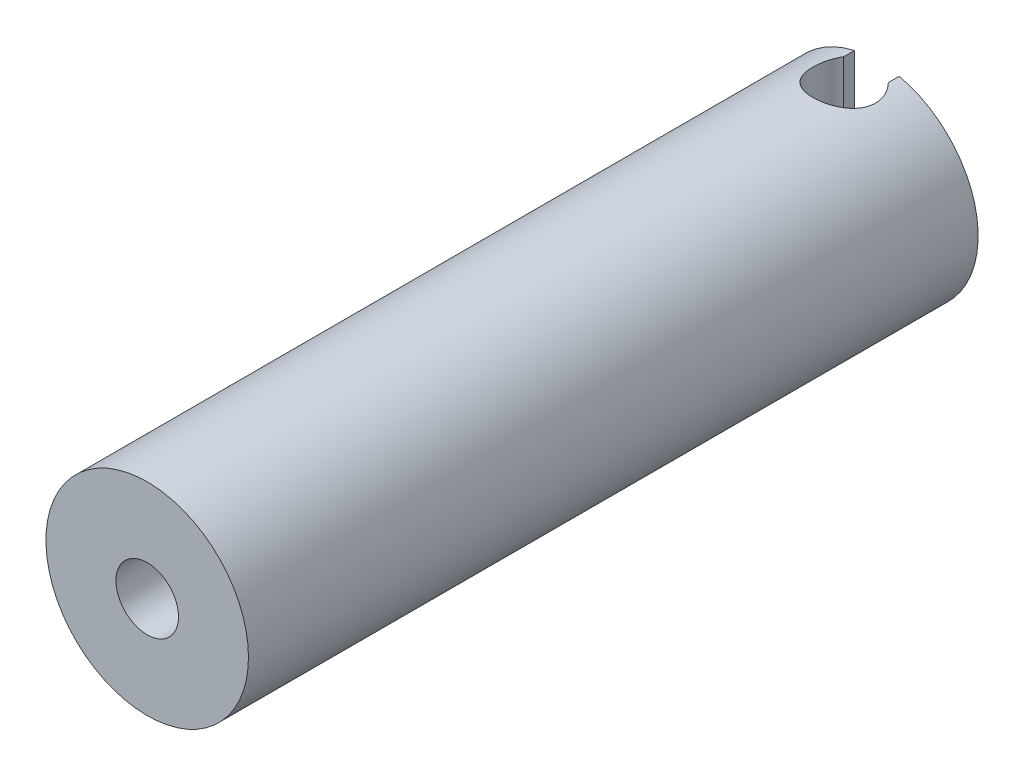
from build123d import *

# Parameters (mm, degrees)
ESQUISSE1_R              = 6.8
BOSS_EXTRU_1_DEPTH       = 49
ESQUISSE2_R              = 2.1
ENL_V_MAT_EXTRU_1_DEPTH  = 50.934757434
ESQUISSE4_R              = 2.1
ENL_V_MAT_EXTRU_9_DEPTH  = 9
ESQUISSE5_W              = 3
ESQUISSE5_H              = 17.0207768
ENL_V_MAT_EXTRU_10_DEPTH = 1.5


with BuildPart() as part:
    # Esquisse1 → Boss.-Extru.1 (new body)
    with BuildSketch(Plane.XY):
        Circle(ESQUISSE1_R)
    extrude(amount=BOSS_EXTRU_1_DEPTH)

    # Esquisse2 → Enl_v. mat.-Extru.1 (cut, through all)
    with BuildSketch(Plane.XY.offset(49)):
        Circle(ESQUISSE2_R)
    extrude(amount=-ENL_V_MAT_EXTRU_1_DEPTH, mode=Mode.SUBTRACT)

    # Esquisse4 → Enl_v. mat.-Extru.9 (cut)
    with BuildSketch(Plane(origin=(0, 10, 0), x_dir=(1, 0, 0), z_dir=(0, 1, 0))):
        with Locations(Location((0, -2.2, 0), (0, 0, 270))):
            Circle(ESQUISSE4_R)
    extrude(amount=-ENL_V_MAT_EXTRU_9_DEPTH, mode=Mode.SUBTRACT)

    # Esquisse5 → Enl_v. mat.-Extru.10 (cut)
    with BuildSketch(Plane(origin=(0, 0, 0), x_dir=(-1, 0, 0), z_dir=(0, 0, -1))):
        Rectangle(ESQUISSE5_W, ESQUISSE5_H)
    extrude(amount=-ENL_V_MAT_EXTRU_10_DEPTH, mode=Mode.SUBTRACT)


solid = part.part
